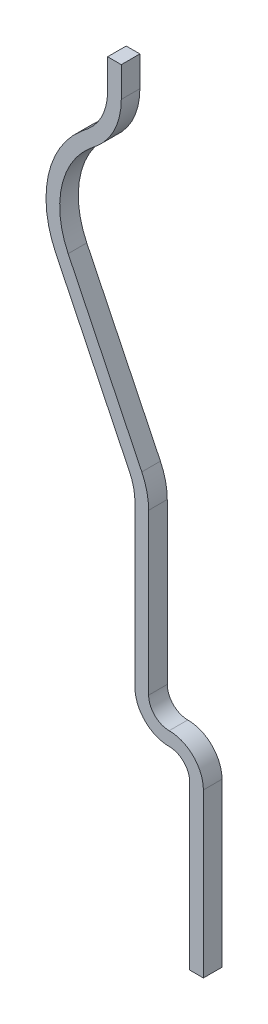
ISO-10303-21;
HEADER;
FILE_DESCRIPTION(('STEP AP214'),'2;1');
FILE_NAME('part.step','',(''),(''),'','','');
FILE_SCHEMA(('AUTOMOTIVE_DESIGN { 1 0 10303 214 1 1 1 1 }'));
ENDSEC;
DATA;
#1=APPLICATION_CONTEXT('core data for automotive mechanical design processes');
#2=APPLICATION_PROTOCOL_DEFINITION('international standard','automotive_design',2000,#1);
#3=PRODUCT_CONTEXT('',#1,'mechanical');
#4=PRODUCT('Part','Part','',(#3));
#5=PRODUCT_RELATED_PRODUCT_CATEGORY('part','',(#4));
#6=PRODUCT_DEFINITION_FORMATION('','',#4);
#7=PRODUCT_DEFINITION_CONTEXT('part definition',#1,'design');
#8=PRODUCT_DEFINITION('design','',#6,#7);
#9=PRODUCT_DEFINITION_SHAPE('','',#8);
#10=(LENGTH_UNIT() NAMED_UNIT(*) SI_UNIT(.MILLI.,.METRE.));
#11=(NAMED_UNIT(*) PLANE_ANGLE_UNIT() SI_UNIT($,.RADIAN.));
#12=(NAMED_UNIT(*) SI_UNIT($,.STERADIAN.) SOLID_ANGLE_UNIT());
#13=UNCERTAINTY_MEASURE_WITH_UNIT(LENGTH_MEASURE(1.E-05),#10,'distance_accuracy_value','');
#14=(GEOMETRIC_REPRESENTATION_CONTEXT(3) GLOBAL_UNCERTAINTY_ASSIGNED_CONTEXT((#13)) GLOBAL_UNIT_ASSIGNED_CONTEXT((#10,
#11,#12)) REPRESENTATION_CONTEXT('',''));
#15=CARTESIAN_POINT('',(0.,0.,0.));
#16=DIRECTION('',(0.,0.,1.));
#17=DIRECTION('',(1.,0.,0.));
#18=AXIS2_PLACEMENT_3D('',#15,#16,#17);
#19=CARTESIAN_POINT('',(0.875,0.,0.34));
#20=DIRECTION('',(1.,0.,0.));
#21=DIRECTION('',(0.,1.,0.));
#22=AXIS2_PLACEMENT_3D('',#19,#20,#21);
#23=PLANE('',#22);
#24=DIRECTION('',(0.,-1.,0.));
#25=VECTOR('',#24,1.);
#26=CARTESIAN_POINT('',(0.875,0.,0.));
#27=LINE('',#26,#25);
#28=CARTESIAN_POINT('',(0.875,2.975,0.));
#29=VERTEX_POINT('',#28);
#30=CARTESIAN_POINT('',(0.875,0.,0.));
#31=VERTEX_POINT('',#30);
#32=EDGE_CURVE('E215',#29,#31,#27,.T.);
#33=ORIENTED_EDGE('',*,*,#32,.T.);
#34=DIRECTION('',(0.,0.,-1.));
#35=VECTOR('',#34,1.);
#36=CARTESIAN_POINT('',(0.875,0.,0.34));
#37=LINE('',#36,#35);
#38=CARTESIAN_POINT('',(0.875,0.,0.34));
#39=VERTEX_POINT('',#38);
#40=EDGE_CURVE('E11',#39,#31,#37,.T.);
#41=ORIENTED_EDGE('',*,*,#40,.F.);
#42=DIRECTION('',(0.,-1.,0.));
#43=VECTOR('',#42,1.);
#44=CARTESIAN_POINT('',(0.875,0.,0.34));
#45=LINE('',#44,#43);
#46=CARTESIAN_POINT('',(0.875,2.975,0.34));
#47=VERTEX_POINT('',#46);
#48=EDGE_CURVE('E257',#47,#39,#45,.T.);
#49=ORIENTED_EDGE('',*,*,#48,.F.);
#50=DIRECTION('',(0.,0.,-1.));
#51=VECTOR('',#50,1.);
#52=CARTESIAN_POINT('',(0.875,2.975,0.34));
#53=LINE('',#52,#51);
#54=EDGE_CURVE('E211',#47,#29,#53,.T.);
#55=ORIENTED_EDGE('',*,*,#54,.T.);
#56=EDGE_LOOP('',(#33,#41,#49,#55));
#57=FACE_BOUND('',#56,.T.);
#58=ADVANCED_FACE('F35',(#57),#23,.F.);
#59=CARTESIAN_POINT('',(0.875,0.,0.34));
#60=DIRECTION('',(0.,1.,0.));
#61=DIRECTION('',(0.,0.,1.));
#62=AXIS2_PLACEMENT_3D('',#59,#60,#61);
#63=PLANE('',#62);
#64=DIRECTION('',(1.,0.,0.));
#65=VECTOR('',#64,1.);
#66=CARTESIAN_POINT('',(0.875,0.,0.));
#67=LINE('',#66,#65);
#68=CARTESIAN_POINT('',(1.125,0.,0.));
#69=VERTEX_POINT('',#68);
#70=EDGE_CURVE('E218',#31,#69,#67,.T.);
#71=ORIENTED_EDGE('',*,*,#70,.T.);
#72=DIRECTION('',(0.,0.,-1.));
#73=VECTOR('',#72,1.);
#74=CARTESIAN_POINT('',(1.125,0.,0.34));
#75=LINE('',#74,#73);
#76=CARTESIAN_POINT('',(1.125,0.,0.34));
#77=VERTEX_POINT('',#76);
#78=EDGE_CURVE('E43',#77,#69,#75,.T.);
#79=ORIENTED_EDGE('',*,*,#78,.F.);
#80=DIRECTION('',(1.,0.,0.));
#81=VECTOR('',#80,1.);
#82=CARTESIAN_POINT('',(0.875,0.,0.34));
#83=LINE('',#82,#81);
#84=EDGE_CURVE('E136',#39,#77,#83,.T.);
#85=ORIENTED_EDGE('',*,*,#84,.F.);
#86=ORIENTED_EDGE('',*,*,#40,.T.);
#87=EDGE_LOOP('',(#71,#79,#85,#86));
#88=FACE_BOUND('',#87,.T.);
#89=ADVANCED_FACE('F385',(#88),#63,.F.);
#90=CARTESIAN_POINT('',(1.125,0.,0.34));
#91=DIRECTION('',(-1.,0.,0.));
#92=DIRECTION('',(0.,0.,1.));
#93=AXIS2_PLACEMENT_3D('',#90,#91,#92);
#94=PLANE('',#93);
#95=DIRECTION('',(0.,1.,0.));
#96=VECTOR('',#95,1.);
#97=CARTESIAN_POINT('',(1.125,0.,0.));
#98=LINE('',#97,#96);
#99=CARTESIAN_POINT('',(1.125,2.975,0.));
#100=VERTEX_POINT('',#99);
#101=EDGE_CURVE('E220',#69,#100,#98,.T.);
#102=ORIENTED_EDGE('',*,*,#101,.T.);
#103=DIRECTION('',(0.,0.,-1.));
#104=VECTOR('',#103,1.);
#105=CARTESIAN_POINT('',(1.125,2.975,0.34));
#106=LINE('',#105,#104);
#107=CARTESIAN_POINT('',(1.125,2.975,0.34));
#108=VERTEX_POINT('',#107);
#109=EDGE_CURVE('E306',#108,#100,#106,.T.);
#110=ORIENTED_EDGE('',*,*,#109,.F.);
#111=DIRECTION('',(0.,1.,0.));
#112=VECTOR('',#111,1.);
#113=CARTESIAN_POINT('',(1.125,0.,0.34));
#114=LINE('',#113,#112);
#115=EDGE_CURVE('E314',#77,#108,#114,.T.);
#116=ORIENTED_EDGE('',*,*,#115,.F.);
#117=ORIENTED_EDGE('',*,*,#78,.T.);
#118=EDGE_LOOP('',(#102,#110,#116,#117));
#119=FACE_BOUND('',#118,.T.);
#120=ADVANCED_FACE('F312',(#119),#94,.F.);
#121=CARTESIAN_POINT('',(0.500000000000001,2.975,0.34));
#122=DIRECTION('',(0.,0.,-1.));
#123=DIRECTION('',(-1.,0.,0.));
#124=AXIS2_PLACEMENT_3D('',#121,#122,#123);
#125=CYLINDRICAL_SURFACE('',#124,0.624999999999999);
#126=CARTESIAN_POINT('',(0.500000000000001,2.975,0.));
#127=DIRECTION('',(0.,0.,1.));
#128=DIRECTION('',(-1.,0.,0.));
#129=AXIS2_PLACEMENT_3D('',#126,#127,#128);
#130=CIRCLE('',#129,0.624999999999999);
#131=CARTESIAN_POINT('',(0.500000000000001,3.6,0.));
#132=VERTEX_POINT('',#131);
#133=EDGE_CURVE('E222',#100,#132,#130,.T.);
#134=ORIENTED_EDGE('',*,*,#133,.T.);
#135=DIRECTION('',(0.,0.,-1.));
#136=VECTOR('',#135,1.);
#137=CARTESIAN_POINT('',(0.500000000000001,3.6,0.34));
#138=LINE('',#137,#136);
#139=CARTESIAN_POINT('',(0.500000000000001,3.6,0.34));
#140=VERTEX_POINT('',#139);
#141=EDGE_CURVE('E303',#140,#132,#138,.T.);
#142=ORIENTED_EDGE('',*,*,#141,.F.);
#143=CARTESIAN_POINT('',(0.500000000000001,2.975,0.34));
#144=DIRECTION('',(0.,0.,1.));
#145=DIRECTION('',(-1.,0.,0.));
#146=AXIS2_PLACEMENT_3D('',#143,#144,#145);
#147=CIRCLE('',#146,0.624999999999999);
#148=EDGE_CURVE('E332',#108,#140,#147,.T.);
#149=ORIENTED_EDGE('',*,*,#148,.F.);
#150=ORIENTED_EDGE('',*,*,#109,.T.);
#151=EDGE_LOOP('',(#134,#142,#149,#150));
#152=FACE_BOUND('',#151,.T.);
#153=ADVANCED_FACE('F323',(#152),#125,.T.);
#154=CARTESIAN_POINT('',(0.500000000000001,3.975,0.34));
#155=DIRECTION('',(0.,0.,-1.));
#156=DIRECTION('',(-1.,0.,0.));
#157=AXIS2_PLACEMENT_3D('',#154,#155,#156);
#158=CYLINDRICAL_SURFACE('',#157,0.375);
#159=CARTESIAN_POINT('',(0.500000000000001,3.975,0.));
#160=DIRECTION('',(0.,0.,-1.));
#161=DIRECTION('',(1.,0.,0.));
#162=AXIS2_PLACEMENT_3D('',#159,#160,#161);
#163=CIRCLE('',#162,0.375);
#164=CARTESIAN_POINT('',(0.125000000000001,3.975,0.));
#165=VERTEX_POINT('',#164);
#166=EDGE_CURVE('E224',#132,#165,#163,.T.);
#167=ORIENTED_EDGE('',*,*,#166,.T.);
#168=DIRECTION('',(0.,0.,-1.));
#169=VECTOR('',#168,1.);
#170=CARTESIAN_POINT('',(0.125000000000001,3.975,0.34));
#171=LINE('',#170,#169);
#172=CARTESIAN_POINT('',(0.125000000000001,3.975,0.34));
#173=VERTEX_POINT('',#172);
#174=EDGE_CURVE('E300',#173,#165,#171,.T.);
#175=ORIENTED_EDGE('',*,*,#174,.F.);
#176=CARTESIAN_POINT('',(0.500000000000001,3.975,0.34));
#177=DIRECTION('',(0.,0.,-1.));
#178=DIRECTION('',(1.,0.,0.));
#179=AXIS2_PLACEMENT_3D('',#176,#177,#178);
#180=CIRCLE('',#179,0.375);
#181=EDGE_CURVE('E329',#140,#173,#180,.T.);
#182=ORIENTED_EDGE('',*,*,#181,.F.);
#183=ORIENTED_EDGE('',*,*,#141,.T.);
#184=EDGE_LOOP('',(#167,#175,#182,#183));
#185=FACE_BOUND('',#184,.T.);
#186=ADVANCED_FACE('F327',(#185),#158,.F.);
#187=CARTESIAN_POINT('',(0.125,6.9,0.34));
#188=DIRECTION('',(-1.,0.,0.));
#189=DIRECTION('',(0.,-1.,0.));
#190=AXIS2_PLACEMENT_3D('',#187,#188,#189);
#191=PLANE('',#190);
#192=DIRECTION('',(0.,1.,0.));
#193=VECTOR('',#192,1.);
#194=CARTESIAN_POINT('',(0.125,6.9,0.));
#195=LINE('',#194,#193);
#196=CARTESIAN_POINT('',(0.125,6.9,0.));
#197=VERTEX_POINT('',#196);
#198=EDGE_CURVE('E226',#165,#197,#195,.T.);
#199=ORIENTED_EDGE('',*,*,#198,.T.);
#200=DIRECTION('',(0.,0.,-1.));
#201=VECTOR('',#200,1.);
#202=CARTESIAN_POINT('',(0.125,6.9,0.34));
#203=LINE('',#202,#201);
#204=CARTESIAN_POINT('',(0.125,6.9,0.34));
#205=VERTEX_POINT('',#204);
#206=EDGE_CURVE('E297',#205,#197,#203,.T.);
#207=ORIENTED_EDGE('',*,*,#206,.F.);
#208=DIRECTION('',(0.,1.,0.));
#209=VECTOR('',#208,1.);
#210=CARTESIAN_POINT('',(0.125,6.9,0.34));
#211=LINE('',#210,#209);
#212=EDGE_CURVE('E331',#173,#205,#211,.T.);
#213=ORIENTED_EDGE('',*,*,#212,.F.);
#214=ORIENTED_EDGE('',*,*,#174,.T.);
#215=EDGE_LOOP('',(#199,#207,#213,#214));
#216=FACE_BOUND('',#215,.T.);
#217=ADVANCED_FACE('F398',(#216),#191,.F.);
#218=CARTESIAN_POINT('',(-1.125,6.9,0.34));
#219=DIRECTION('',(0.,0.,-1.));
#220=DIRECTION('',(-1.,0.,0.));
#221=AXIS2_PLACEMENT_3D('',#218,#219,#220);
#222=CYLINDRICAL_SURFACE('',#221,1.25);
#223=CARTESIAN_POINT('',(-1.125,6.9,0.));
#224=DIRECTION('',(0.,0.,1.));
#225=DIRECTION('',(1.,0.,0.));
#226=AXIS2_PLACEMENT_3D('',#223,#224,#225);
#227=CIRCLE('',#226,1.25);
#228=CARTESIAN_POINT('',(0.000186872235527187,7.44447635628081,0.));
#229=VERTEX_POINT('',#228);
#230=EDGE_CURVE('E228',#197,#229,#227,.T.);
#231=ORIENTED_EDGE('',*,*,#230,.T.);
#232=DIRECTION('',(0.,0.,-1.));
#233=VECTOR('',#232,1.);
#234=CARTESIAN_POINT('',(0.000186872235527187,7.44447635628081,0.34));
#235=LINE('',#234,#233);
#236=CARTESIAN_POINT('',(0.000186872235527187,7.44447635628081,0.34));
#237=VERTEX_POINT('',#236);
#238=EDGE_CURVE('E294',#237,#229,#235,.T.);
#239=ORIENTED_EDGE('',*,*,#238,.F.);
#240=CARTESIAN_POINT('',(-1.125,6.9,0.34));
#241=DIRECTION('',(0.,0.,1.));
#242=DIRECTION('',(1.,0.,0.));
#243=AXIS2_PLACEMENT_3D('',#240,#241,#242);
#244=CIRCLE('',#243,1.25);
#245=EDGE_CURVE('E334',#205,#237,#244,.T.);
#246=ORIENTED_EDGE('',*,*,#245,.F.);
#247=ORIENTED_EDGE('',*,*,#206,.T.);
#248=EDGE_LOOP('',(#231,#239,#246,#247));
#249=FACE_BOUND('',#248,.T.);
#250=ADVANCED_FACE('F401',(#249),#222,.T.);
#251=CARTESIAN_POINT('',(-1.34523172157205,10.2248493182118,0.34));
#252=DIRECTION('',(-0.900149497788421,-0.435581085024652,0.));
#253=DIRECTION('',(0.435581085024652,-0.900149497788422,0.));
#254=AXIS2_PLACEMENT_3D('',#251,#252,#253);
#255=PLANE('',#254);
#256=DIRECTION('',(-0.435581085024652,0.900149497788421,0.));
#257=VECTOR('',#256,1.);
#258=CARTESIAN_POINT('',(-1.34523172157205,10.2248493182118,0.));
#259=LINE('',#258,#257);
#260=CARTESIAN_POINT('',(-1.34523172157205,10.2248493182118,0.));
#261=VERTEX_POINT('',#260);
#262=EDGE_CURVE('E230',#229,#261,#259,.T.);
#263=ORIENTED_EDGE('',*,*,#262,.T.);
#264=DIRECTION('',(0.,0.,-1.));
#265=VECTOR('',#264,1.);
#266=CARTESIAN_POINT('',(-1.34523172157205,10.2248493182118,0.34));
#267=LINE('',#266,#265);
#268=CARTESIAN_POINT('',(-1.34523172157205,10.2248493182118,0.34));
#269=VERTEX_POINT('',#268);
#270=EDGE_CURVE('E291',#269,#261,#267,.T.);
#271=ORIENTED_EDGE('',*,*,#270,.F.);
#272=DIRECTION('',(-0.435581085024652,0.900149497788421,0.));
#273=VECTOR('',#272,1.);
#274=CARTESIAN_POINT('',(-1.34523172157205,10.2248493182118,0.34));
#275=LINE('',#274,#273);
#276=EDGE_CURVE('E340',#237,#269,#275,.T.);
#277=ORIENTED_EDGE('',*,*,#276,.F.);
#278=ORIENTED_EDGE('',*,*,#238,.T.);
#279=EDGE_LOOP('',(#263,#271,#277,#278));
#280=FACE_BOUND('',#279,.T.);
#281=ADVANCED_FACE('F405',(#280),#255,.F.);
#282=CARTESIAN_POINT('',(0.0500000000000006,10.9,0.34));
#283=DIRECTION('',(0.,0.,-1.));
#284=DIRECTION('',(-1.,0.,0.));
#285=AXIS2_PLACEMENT_3D('',#282,#283,#284);
#286=CYLINDRICAL_SURFACE('',#285,1.55);
#287=CARTESIAN_POINT('',(0.0500000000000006,10.9,0.));
#288=DIRECTION('',(0.,0.,-1.));
#289=DIRECTION('',(1.,0.,0.));
#290=AXIS2_PLACEMENT_3D('',#287,#288,#289);
#291=CIRCLE('',#290,1.55);
#292=CARTESIAN_POINT('',(-0.948252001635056,12.0857457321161,0.));
#293=VERTEX_POINT('',#292);
#294=EDGE_CURVE('E232',#261,#293,#291,.T.);
#295=ORIENTED_EDGE('',*,*,#294,.T.);
#296=DIRECTION('',(0.,0.,-1.));
#297=VECTOR('',#296,1.);
#298=CARTESIAN_POINT('',(-0.948252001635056,12.0857457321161,0.34));
#299=LINE('',#298,#297);
#300=CARTESIAN_POINT('',(-0.948252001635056,12.0857457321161,0.34));
#301=VERTEX_POINT('',#300);
#302=EDGE_CURVE('E288',#301,#293,#299,.T.);
#303=ORIENTED_EDGE('',*,*,#302,.F.);
#304=CARTESIAN_POINT('',(0.0500000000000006,10.9,0.34));
#305=DIRECTION('',(0.,0.,-1.));
#306=DIRECTION('',(1.,0.,0.));
#307=AXIS2_PLACEMENT_3D('',#304,#305,#306);
#308=CIRCLE('',#307,1.55);
#309=EDGE_CURVE('E342',#269,#301,#308,.T.);
#310=ORIENTED_EDGE('',*,*,#309,.F.);
#311=ORIENTED_EDGE('',*,*,#270,.T.);
#312=EDGE_LOOP('',(#295,#303,#310,#311));
#313=FACE_BOUND('',#312,.T.);
#314=ADVANCED_FACE('F409',(#313),#286,.F.);
#315=CARTESIAN_POINT('',(-0.819958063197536,12.1937534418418,0.34));
#316=DIRECTION('',(-0.644033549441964,0.764997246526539,0.));
#317=DIRECTION('',(-0.764997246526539,-0.644033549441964,0.));
#318=AXIS2_PLACEMENT_3D('',#315,#316,#317);
#319=PLANE('',#318);
#320=DIRECTION('',(0.764997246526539,0.644033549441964,0.));
#321=VECTOR('',#320,1.);
#322=CARTESIAN_POINT('',(-0.819958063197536,12.1937534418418,0.));
#323=LINE('',#322,#321);
#324=CARTESIAN_POINT('',(-0.819958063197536,12.1937534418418,0.));
#325=VERTEX_POINT('',#324);
#326=EDGE_CURVE('E234',#293,#325,#323,.T.);
#327=ORIENTED_EDGE('',*,*,#326,.T.);
#328=DIRECTION('',(0.,0.,-1.));
#329=VECTOR('',#328,1.);
#330=CARTESIAN_POINT('',(-0.819958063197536,12.1937534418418,0.34));
#331=LINE('',#330,#329);
#332=CARTESIAN_POINT('',(-0.819958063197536,12.1937534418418,0.34));
#333=VERTEX_POINT('',#332);
#334=EDGE_CURVE('E285',#333,#325,#331,.T.);
#335=ORIENTED_EDGE('',*,*,#334,.F.);
#336=DIRECTION('',(0.764997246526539,0.644033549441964,0.));
#337=VECTOR('',#336,1.);
#338=CARTESIAN_POINT('',(-0.819958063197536,12.1937534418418,0.34));
#339=LINE('',#338,#337);
#340=EDGE_CURVE('E344',#301,#333,#339,.T.);
#341=ORIENTED_EDGE('',*,*,#340,.F.);
#342=ORIENTED_EDGE('',*,*,#302,.T.);
#343=EDGE_LOOP('',(#327,#335,#341,#342));
#344=FACE_BOUND('',#343,.T.);
#345=ADVANCED_FACE('F413',(#344),#319,.F.);
#346=CARTESIAN_POINT('',(-1.625,13.15,0.34));
#347=DIRECTION('',(0.,0.,-1.));
#348=DIRECTION('',(-1.,0.,0.));
#349=AXIS2_PLACEMENT_3D('',#346,#347,#348);
#350=CYLINDRICAL_SURFACE('',#349,1.25);
#351=CARTESIAN_POINT('',(-1.625,13.15,0.));
#352=DIRECTION('',(0.,0.,1.));
#353=DIRECTION('',(-1.,0.,0.));
#354=AXIS2_PLACEMENT_3D('',#351,#352,#353);
#355=CIRCLE('',#354,1.25);
#356=CARTESIAN_POINT('',(-0.375000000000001,13.15,0.));
#357=VERTEX_POINT('',#356);
#358=EDGE_CURVE('E236',#325,#357,#355,.T.);
#359=ORIENTED_EDGE('',*,*,#358,.T.);
#360=DIRECTION('',(0.,0.,-1.));
#361=VECTOR('',#360,1.);
#362=CARTESIAN_POINT('',(-0.375000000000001,13.15,0.34));
#363=LINE('',#362,#361);
#364=CARTESIAN_POINT('',(-0.375000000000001,13.15,0.34));
#365=VERTEX_POINT('',#364);
#366=EDGE_CURVE('E282',#365,#357,#363,.T.);
#367=ORIENTED_EDGE('',*,*,#366,.F.);
#368=CARTESIAN_POINT('',(-1.625,13.15,0.34));
#369=DIRECTION('',(0.,0.,1.));
#370=DIRECTION('',(-1.,0.,0.));
#371=AXIS2_PLACEMENT_3D('',#368,#369,#370);
#372=CIRCLE('',#371,1.25);
#373=EDGE_CURVE('E346',#333,#365,#372,.T.);
#374=ORIENTED_EDGE('',*,*,#373,.F.);
#375=ORIENTED_EDGE('',*,*,#334,.T.);
#376=EDGE_LOOP('',(#359,#367,#374,#375));
#377=FACE_BOUND('',#376,.T.);
#378=ADVANCED_FACE('F417',(#377),#350,.T.);
#379=CARTESIAN_POINT('',(-0.375,13.7,0.34));
#380=DIRECTION('',(-1.,0.,0.));
#381=DIRECTION('',(0.,0.,1.));
#382=AXIS2_PLACEMENT_3D('',#379,#380,#381);
#383=PLANE('',#382);
#384=DIRECTION('',(0.,1.,0.));
#385=VECTOR('',#384,1.);
#386=CARTESIAN_POINT('',(-0.375,13.7,0.));
#387=LINE('',#386,#385);
#388=CARTESIAN_POINT('',(-0.375,13.7,0.));
#389=VERTEX_POINT('',#388);
#390=EDGE_CURVE('E238',#357,#389,#387,.T.);
#391=ORIENTED_EDGE('',*,*,#390,.T.);
#392=DIRECTION('',(0.,0.,-1.));
#393=VECTOR('',#392,1.);
#394=CARTESIAN_POINT('',(-0.375,13.7,0.34));
#395=LINE('',#394,#393);
#396=CARTESIAN_POINT('',(-0.375,13.7,0.34));
#397=VERTEX_POINT('',#396);
#398=EDGE_CURVE('E279',#397,#389,#395,.T.);
#399=ORIENTED_EDGE('',*,*,#398,.F.);
#400=DIRECTION('',(0.,1.,0.));
#401=VECTOR('',#400,1.);
#402=CARTESIAN_POINT('',(-0.375,13.7,0.34));
#403=LINE('',#402,#401);
#404=EDGE_CURVE('E348',#365,#397,#403,.T.);
#405=ORIENTED_EDGE('',*,*,#404,.F.);
#406=ORIENTED_EDGE('',*,*,#366,.T.);
#407=EDGE_LOOP('',(#391,#399,#405,#406));
#408=FACE_BOUND('',#407,.T.);
#409=ADVANCED_FACE('F421',(#408),#383,.F.);
#410=CARTESIAN_POINT('',(-0.625,13.7,0.34));
#411=DIRECTION('',(0.,-1.,0.));
#412=DIRECTION('',(0.,0.,-1.));
#413=AXIS2_PLACEMENT_3D('',#410,#411,#412);
#414=PLANE('',#413);
#415=DIRECTION('',(-1.,0.,0.));
#416=VECTOR('',#415,1.);
#417=CARTESIAN_POINT('',(-0.625,13.7,0.));
#418=LINE('',#417,#416);
#419=CARTESIAN_POINT('',(-0.625,13.7,0.));
#420=VERTEX_POINT('',#419);
#421=EDGE_CURVE('E240',#389,#420,#418,.T.);
#422=ORIENTED_EDGE('',*,*,#421,.T.);
#423=DIRECTION('',(0.,0.,-1.));
#424=VECTOR('',#423,1.);
#425=CARTESIAN_POINT('',(-0.625,13.7,0.34));
#426=LINE('',#425,#424);
#427=CARTESIAN_POINT('',(-0.625,13.7,0.34));
#428=VERTEX_POINT('',#427);
#429=EDGE_CURVE('E276',#428,#420,#426,.T.);
#430=ORIENTED_EDGE('',*,*,#429,.F.);
#431=DIRECTION('',(-1.,0.,0.));
#432=VECTOR('',#431,1.);
#433=CARTESIAN_POINT('',(-0.625,13.7,0.34));
#434=LINE('',#433,#432);
#435=EDGE_CURVE('E350',#397,#428,#434,.T.);
#436=ORIENTED_EDGE('',*,*,#435,.F.);
#437=ORIENTED_EDGE('',*,*,#398,.T.);
#438=EDGE_LOOP('',(#422,#430,#436,#437));
#439=FACE_BOUND('',#438,.T.);
#440=ADVANCED_FACE('F425',(#439),#414,.F.);
#441=CARTESIAN_POINT('',(-0.625,13.7,0.34));
#442=DIRECTION('',(1.,0.,0.));
#443=DIRECTION('',(0.,0.,-1.));
#444=AXIS2_PLACEMENT_3D('',#441,#442,#443);
#445=PLANE('',#444);
#446=DIRECTION('',(0.,-1.,0.));
#447=VECTOR('',#446,1.);
#448=CARTESIAN_POINT('',(-0.625,13.7,0.));
#449=LINE('',#448,#447);
#450=CARTESIAN_POINT('',(-0.625,13.15,0.));
#451=VERTEX_POINT('',#450);
#452=EDGE_CURVE('E242',#420,#451,#449,.T.);
#453=ORIENTED_EDGE('',*,*,#452,.T.);
#454=DIRECTION('',(0.,0.,-1.));
#455=VECTOR('',#454,1.);
#456=CARTESIAN_POINT('',(-0.625,13.15,0.34));
#457=LINE('',#456,#455);
#458=CARTESIAN_POINT('',(-0.625,13.15,0.34));
#459=VERTEX_POINT('',#458);
#460=EDGE_CURVE('E273',#459,#451,#457,.T.);
#461=ORIENTED_EDGE('',*,*,#460,.F.);
#462=DIRECTION('',(0.,-1.,0.));
#463=VECTOR('',#462,1.);
#464=CARTESIAN_POINT('',(-0.625,13.7,0.34));
#465=LINE('',#464,#463);
#466=EDGE_CURVE('E352',#428,#459,#465,.T.);
#467=ORIENTED_EDGE('',*,*,#466,.F.);
#468=ORIENTED_EDGE('',*,*,#429,.T.);
#469=EDGE_LOOP('',(#453,#461,#467,#468));
#470=FACE_BOUND('',#469,.T.);
#471=ADVANCED_FACE('F429',(#470),#445,.F.);
#472=CARTESIAN_POINT('',(-1.625,13.15,0.34));
#473=DIRECTION('',(0.,0.,-1.));
#474=DIRECTION('',(-1.,0.,0.));
#475=AXIS2_PLACEMENT_3D('',#472,#473,#474);
#476=CYLINDRICAL_SURFACE('',#475,1.);
#477=CARTESIAN_POINT('',(-1.625,13.15,0.));
#478=DIRECTION('',(0.,0.,-1.));
#479=DIRECTION('',(-1.,0.,0.));
#480=AXIS2_PLACEMENT_3D('',#477,#478,#479);
#481=CIRCLE('',#480,1.);
#482=CARTESIAN_POINT('',(-0.980966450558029,12.3850027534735,0.));
#483=VERTEX_POINT('',#482);
#484=EDGE_CURVE('E244',#451,#483,#481,.T.);
#485=ORIENTED_EDGE('',*,*,#484,.T.);
#486=DIRECTION('',(0.,0.,-1.));
#487=VECTOR('',#486,1.);
#488=CARTESIAN_POINT('',(-0.980966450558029,12.3850027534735,0.34));
#489=LINE('',#488,#487);
#490=CARTESIAN_POINT('',(-0.980966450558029,12.3850027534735,0.34));
#491=VERTEX_POINT('',#490);
#492=EDGE_CURVE('E270',#491,#483,#489,.T.);
#493=ORIENTED_EDGE('',*,*,#492,.F.);
#494=CARTESIAN_POINT('',(-1.625,13.15,0.34));
#495=DIRECTION('',(0.,0.,-1.));
#496=DIRECTION('',(-1.,0.,0.));
#497=AXIS2_PLACEMENT_3D('',#494,#495,#496);
#498=CIRCLE('',#497,1.);
#499=EDGE_CURVE('E354',#459,#491,#498,.T.);
#500=ORIENTED_EDGE('',*,*,#499,.F.);
#501=ORIENTED_EDGE('',*,*,#460,.T.);
#502=EDGE_LOOP('',(#485,#493,#500,#501));
#503=FACE_BOUND('',#502,.T.);
#504=ADVANCED_FACE('F433',(#503),#476,.F.);
#505=CARTESIAN_POINT('',(-0.980966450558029,12.3850027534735,0.34));
#506=DIRECTION('',(0.644033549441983,-0.764997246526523,0.));
#507=DIRECTION('',(0.764997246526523,0.644033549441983,0.));
#508=AXIS2_PLACEMENT_3D('',#505,#506,#507);
#509=PLANE('',#508);
#510=DIRECTION('',(-0.764997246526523,-0.644033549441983,0.));
#511=VECTOR('',#510,1.);
#512=CARTESIAN_POINT('',(-0.980966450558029,12.3850027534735,0.));
#513=LINE('',#512,#511);
#514=CARTESIAN_POINT('',(-1.10926038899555,12.2769950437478,0.));
#515=VERTEX_POINT('',#514);
#516=EDGE_CURVE('E246',#483,#515,#513,.T.);
#517=ORIENTED_EDGE('',*,*,#516,.T.);
#518=DIRECTION('',(0.,0.,-1.));
#519=VECTOR('',#518,1.);
#520=CARTESIAN_POINT('',(-1.10926038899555,12.2769950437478,0.34));
#521=LINE('',#520,#519);
#522=CARTESIAN_POINT('',(-1.10926038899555,12.2769950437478,0.34));
#523=VERTEX_POINT('',#522);
#524=EDGE_CURVE('E267',#523,#515,#521,.T.);
#525=ORIENTED_EDGE('',*,*,#524,.F.);
#526=DIRECTION('',(-0.764997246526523,-0.644033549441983,0.));
#527=VECTOR('',#526,1.);
#528=CARTESIAN_POINT('',(-0.980966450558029,12.3850027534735,0.34));
#529=LINE('',#528,#527);
#530=EDGE_CURVE('E356',#491,#523,#529,.T.);
#531=ORIENTED_EDGE('',*,*,#530,.F.);
#532=ORIENTED_EDGE('',*,*,#492,.T.);
#533=EDGE_LOOP('',(#517,#525,#531,#532));
#534=FACE_BOUND('',#533,.T.);
#535=ADVANCED_FACE('F437',(#534),#509,.F.);
#536=CARTESIAN_POINT('',(0.0500000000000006,10.9,0.34));
#537=DIRECTION('',(0.,0.,-1.));
#538=DIRECTION('',(-1.,0.,0.));
#539=AXIS2_PLACEMENT_3D('',#536,#537,#538);
#540=CYLINDRICAL_SURFACE('',#539,1.8);
#541=CARTESIAN_POINT('',(0.0500000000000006,10.9,0.));
#542=DIRECTION('',(0.,0.,1.));
#543=DIRECTION('',(1.,0.,0.));
#544=AXIS2_PLACEMENT_3D('',#541,#542,#543);
#545=CIRCLE('',#544,1.8);
#546=CARTESIAN_POINT('',(-1.57026909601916,10.1159540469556,0.));
#547=VERTEX_POINT('',#546);
#548=EDGE_CURVE('E248',#515,#547,#545,.T.);
#549=ORIENTED_EDGE('',*,*,#548,.T.);
#550=DIRECTION('',(0.,0.,-1.));
#551=VECTOR('',#550,1.);
#552=CARTESIAN_POINT('',(-1.57026909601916,10.1159540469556,0.34));
#553=LINE('',#552,#551);
#554=CARTESIAN_POINT('',(-1.57026909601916,10.1159540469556,0.34));
#555=VERTEX_POINT('',#554);
#556=EDGE_CURVE('E264',#555,#547,#553,.T.);
#557=ORIENTED_EDGE('',*,*,#556,.F.);
#558=CARTESIAN_POINT('',(0.0500000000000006,10.9,0.34));
#559=DIRECTION('',(0.,0.,1.));
#560=DIRECTION('',(1.,0.,0.));
#561=AXIS2_PLACEMENT_3D('',#558,#559,#560);
#562=CIRCLE('',#561,1.8);
#563=EDGE_CURVE('E358',#523,#555,#562,.T.);
#564=ORIENTED_EDGE('',*,*,#563,.F.);
#565=ORIENTED_EDGE('',*,*,#524,.T.);
#566=EDGE_LOOP('',(#549,#557,#564,#565));
#567=FACE_BOUND('',#566,.T.);
#568=ADVANCED_FACE('F441',(#567),#540,.T.);
#569=CARTESIAN_POINT('',(-0.224850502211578,7.33558108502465,0.34));
#570=DIRECTION('',(0.900149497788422,0.435581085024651,0.));
#571=DIRECTION('',(-0.435581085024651,0.900149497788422,0.));
#572=AXIS2_PLACEMENT_3D('',#569,#570,#571);
#573=PLANE('',#572);
#574=DIRECTION('',(0.435581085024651,-0.900149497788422,0.));
#575=VECTOR('',#574,1.);
#576=CARTESIAN_POINT('',(-0.224850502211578,7.33558108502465,0.));
#577=LINE('',#576,#575);
#578=CARTESIAN_POINT('',(-0.224850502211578,7.33558108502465,0.));
#579=VERTEX_POINT('',#578);
#580=EDGE_CURVE('E250',#547,#579,#577,.T.);
#581=ORIENTED_EDGE('',*,*,#580,.T.);
#582=DIRECTION('',(0.,0.,-1.));
#583=VECTOR('',#582,1.);
#584=CARTESIAN_POINT('',(-0.224850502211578,7.33558108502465,0.34));
#585=LINE('',#584,#583);
#586=CARTESIAN_POINT('',(-0.224850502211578,7.33558108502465,0.34));
#587=VERTEX_POINT('',#586);
#588=EDGE_CURVE('E261',#587,#579,#585,.T.);
#589=ORIENTED_EDGE('',*,*,#588,.F.);
#590=DIRECTION('',(0.435581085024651,-0.900149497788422,0.));
#591=VECTOR('',#590,1.);
#592=CARTESIAN_POINT('',(-0.224850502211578,7.33558108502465,0.34));
#593=LINE('',#592,#591);
#594=EDGE_CURVE('E360',#555,#587,#593,.T.);
#595=ORIENTED_EDGE('',*,*,#594,.F.);
#596=ORIENTED_EDGE('',*,*,#556,.T.);
#597=EDGE_LOOP('',(#581,#589,#595,#596));
#598=FACE_BOUND('',#597,.T.);
#599=ADVANCED_FACE('F366',(#598),#573,.F.);
#600=CARTESIAN_POINT('',(-1.125,6.9,0.34));
#601=DIRECTION('',(0.,0.,-1.));
#602=DIRECTION('',(-1.,0.,0.));
#603=AXIS2_PLACEMENT_3D('',#600,#601,#602);
#604=CYLINDRICAL_SURFACE('',#603,1.);
#605=CARTESIAN_POINT('',(-1.125,6.9,0.));
#606=DIRECTION('',(0.,0.,-1.));
#607=DIRECTION('',(1.,0.,0.));
#608=AXIS2_PLACEMENT_3D('',#605,#606,#607);
#609=CIRCLE('',#608,1.);
#610=CARTESIAN_POINT('',(-0.125,6.9,0.));
#611=VERTEX_POINT('',#610);
#612=EDGE_CURVE('E252',#579,#611,#609,.T.);
#613=ORIENTED_EDGE('',*,*,#612,.T.);
#614=DIRECTION('',(0.,0.,-1.));
#615=VECTOR('',#614,1.);
#616=CARTESIAN_POINT('',(-0.125,6.9,0.34));
#617=LINE('',#616,#615);
#618=CARTESIAN_POINT('',(-0.125,6.9,0.34));
#619=VERTEX_POINT('',#618);
#620=EDGE_CURVE('E206',#619,#611,#617,.T.);
#621=ORIENTED_EDGE('',*,*,#620,.F.);
#622=CARTESIAN_POINT('',(-1.125,6.9,0.34));
#623=DIRECTION('',(0.,0.,-1.));
#624=DIRECTION('',(1.,0.,0.));
#625=AXIS2_PLACEMENT_3D('',#622,#623,#624);
#626=CIRCLE('',#625,1.);
#627=EDGE_CURVE('E197',#587,#619,#626,.T.);
#628=ORIENTED_EDGE('',*,*,#627,.F.);
#629=ORIENTED_EDGE('',*,*,#588,.T.);
#630=EDGE_LOOP('',(#613,#621,#628,#629));
#631=FACE_BOUND('',#630,.T.);
#632=ADVANCED_FACE('F370',(#631),#604,.F.);
#633=CARTESIAN_POINT('',(-0.125,6.9,0.34));
#634=DIRECTION('',(1.,0.,0.));
#635=DIRECTION('',(0.,1.,0.));
#636=AXIS2_PLACEMENT_3D('',#633,#634,#635);
#637=PLANE('',#636);
#638=DIRECTION('',(0.,-1.,0.));
#639=VECTOR('',#638,1.);
#640=CARTESIAN_POINT('',(-0.125,6.9,0.));
#641=LINE('',#640,#639);
#642=CARTESIAN_POINT('',(-0.125,3.975,0.));
#643=VERTEX_POINT('',#642);
#644=EDGE_CURVE('E205',#611,#643,#641,.T.);
#645=ORIENTED_EDGE('',*,*,#644,.T.);
#646=DIRECTION('',(0.,0.,-1.));
#647=VECTOR('',#646,1.);
#648=CARTESIAN_POINT('',(-0.125,3.975,0.34));
#649=LINE('',#648,#647);
#650=CARTESIAN_POINT('',(-0.125,3.975,0.34));
#651=VERTEX_POINT('',#650);
#652=EDGE_CURVE('E202',#651,#643,#649,.T.);
#653=ORIENTED_EDGE('',*,*,#652,.F.);
#654=DIRECTION('',(0.,-1.,0.));
#655=VECTOR('',#654,1.);
#656=CARTESIAN_POINT('',(-0.125,6.9,0.34));
#657=LINE('',#656,#655);
#658=EDGE_CURVE('E191',#619,#651,#657,.T.);
#659=ORIENTED_EDGE('',*,*,#658,.F.);
#660=ORIENTED_EDGE('',*,*,#620,.T.);
#661=EDGE_LOOP('',(#645,#653,#659,#660));
#662=FACE_BOUND('',#661,.T.);
#663=ADVANCED_FACE('F203',(#662),#637,.F.);
#664=CARTESIAN_POINT('',(0.500000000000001,3.975,0.34));
#665=DIRECTION('',(0.,0.,-1.));
#666=DIRECTION('',(-1.,0.,0.));
#667=AXIS2_PLACEMENT_3D('',#664,#665,#666);
#668=CYLINDRICAL_SURFACE('',#667,0.625);
#669=CARTESIAN_POINT('',(0.500000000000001,3.975,0.));
#670=DIRECTION('',(0.,0.,1.));
#671=DIRECTION('',(-1.,0.,0.));
#672=AXIS2_PLACEMENT_3D('',#669,#670,#671);
#673=CIRCLE('',#672,0.625);
#674=CARTESIAN_POINT('',(0.500000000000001,3.35,0.));
#675=VERTEX_POINT('',#674);
#676=EDGE_CURVE('E122',#643,#675,#673,.T.);
#677=ORIENTED_EDGE('',*,*,#676,.T.);
#678=DIRECTION('',(0.,0.,-1.));
#679=VECTOR('',#678,1.);
#680=CARTESIAN_POINT('',(0.500000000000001,3.35,0.34));
#681=LINE('',#680,#679);
#682=CARTESIAN_POINT('',(0.500000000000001,3.35,0.34));
#683=VERTEX_POINT('',#682);
#684=EDGE_CURVE('E207',#683,#675,#681,.T.);
#685=ORIENTED_EDGE('',*,*,#684,.F.);
#686=CARTESIAN_POINT('',(0.500000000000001,3.975,0.34));
#687=DIRECTION('',(0.,0.,1.));
#688=DIRECTION('',(-1.,0.,0.));
#689=AXIS2_PLACEMENT_3D('',#686,#687,#688);
#690=CIRCLE('',#689,0.625);
#691=EDGE_CURVE('E195',#651,#683,#690,.T.);
#692=ORIENTED_EDGE('',*,*,#691,.F.);
#693=ORIENTED_EDGE('',*,*,#652,.T.);
#694=EDGE_LOOP('',(#677,#685,#692,#693));
#695=FACE_BOUND('',#694,.T.);
#696=ADVANCED_FACE('F209',(#695),#668,.T.);
#697=CARTESIAN_POINT('',(0.500000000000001,2.975,0.34));
#698=DIRECTION('',(0.,0.,-1.));
#699=DIRECTION('',(-1.,0.,0.));
#700=AXIS2_PLACEMENT_3D('',#697,#698,#699);
#701=CYLINDRICAL_SURFACE('',#700,0.374999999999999);
#702=CARTESIAN_POINT('',(0.500000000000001,2.975,0.));
#703=DIRECTION('',(0.,0.,-1.));
#704=DIRECTION('',(1.,0.,0.));
#705=AXIS2_PLACEMENT_3D('',#702,#703,#704);
#706=CIRCLE('',#705,0.374999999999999);
#707=EDGE_CURVE('E128',#675,#29,#706,.T.);
#708=ORIENTED_EDGE('',*,*,#707,.T.);
#709=ORIENTED_EDGE('',*,*,#54,.F.);
#710=CARTESIAN_POINT('',(0.500000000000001,2.975,0.34));
#711=DIRECTION('',(0.,0.,-1.));
#712=DIRECTION('',(1.,0.,0.));
#713=AXIS2_PLACEMENT_3D('',#710,#711,#712);
#714=CIRCLE('',#713,0.374999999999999);
#715=EDGE_CURVE('E51',#683,#47,#714,.T.);
#716=ORIENTED_EDGE('',*,*,#715,.F.);
#717=ORIENTED_EDGE('',*,*,#684,.T.);
#718=EDGE_LOOP('',(#708,#709,#716,#717));
#719=FACE_BOUND('',#718,.T.);
#720=ADVANCED_FACE('F374',(#719),#701,.F.);
#721=CARTESIAN_POINT('',(0.500000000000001,2.975,0.34));
#722=DIRECTION('',(0.,0.,1.));
#723=DIRECTION('',(1.,0.,0.));
#724=AXIS2_PLACEMENT_3D('',#721,#722,#723);
#725=PLANE('',#724);
#726=ORIENTED_EDGE('',*,*,#48,.T.);
#727=ORIENTED_EDGE('',*,*,#84,.T.);
#728=ORIENTED_EDGE('',*,*,#115,.T.);
#729=ORIENTED_EDGE('',*,*,#148,.T.);
#730=ORIENTED_EDGE('',*,*,#181,.T.);
#731=ORIENTED_EDGE('',*,*,#212,.T.);
#732=ORIENTED_EDGE('',*,*,#245,.T.);
#733=ORIENTED_EDGE('',*,*,#276,.T.);
#734=ORIENTED_EDGE('',*,*,#309,.T.);
#735=ORIENTED_EDGE('',*,*,#340,.T.);
#736=ORIENTED_EDGE('',*,*,#373,.T.);
#737=ORIENTED_EDGE('',*,*,#404,.T.);
#738=ORIENTED_EDGE('',*,*,#435,.T.);
#739=ORIENTED_EDGE('',*,*,#466,.T.);
#740=ORIENTED_EDGE('',*,*,#499,.T.);
#741=ORIENTED_EDGE('',*,*,#530,.T.);
#742=ORIENTED_EDGE('',*,*,#563,.T.);
#743=ORIENTED_EDGE('',*,*,#594,.T.);
#744=ORIENTED_EDGE('',*,*,#627,.T.);
#745=ORIENTED_EDGE('',*,*,#658,.T.);
#746=ORIENTED_EDGE('',*,*,#691,.T.);
#747=ORIENTED_EDGE('',*,*,#715,.T.);
#748=EDGE_LOOP('',(#726,#727,#728,#729,#730,#731,#732,#733,#734,#735,#736,#737,#738,#739,#740,
#741,#742,#743,#744,#745,#746,#747));
#749=FACE_BOUND('',#748,.T.);
#750=ADVANCED_FACE('F193',(#749),#725,.T.);
#751=CARTESIAN_POINT('',(0.500000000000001,2.975,0.));
#752=DIRECTION('',(0.,0.,1.));
#753=DIRECTION('',(1.,0.,0.));
#754=AXIS2_PLACEMENT_3D('',#751,#752,#753);
#755=PLANE('',#754);
#756=ORIENTED_EDGE('',*,*,#32,.F.);
#757=ORIENTED_EDGE('',*,*,#707,.F.);
#758=ORIENTED_EDGE('',*,*,#676,.F.);
#759=ORIENTED_EDGE('',*,*,#644,.F.);
#760=ORIENTED_EDGE('',*,*,#612,.F.);
#761=ORIENTED_EDGE('',*,*,#580,.F.);
#762=ORIENTED_EDGE('',*,*,#548,.F.);
#763=ORIENTED_EDGE('',*,*,#516,.F.);
#764=ORIENTED_EDGE('',*,*,#484,.F.);
#765=ORIENTED_EDGE('',*,*,#452,.F.);
#766=ORIENTED_EDGE('',*,*,#421,.F.);
#767=ORIENTED_EDGE('',*,*,#390,.F.);
#768=ORIENTED_EDGE('',*,*,#358,.F.);
#769=ORIENTED_EDGE('',*,*,#326,.F.);
#770=ORIENTED_EDGE('',*,*,#294,.F.);
#771=ORIENTED_EDGE('',*,*,#262,.F.);
#772=ORIENTED_EDGE('',*,*,#230,.F.);
#773=ORIENTED_EDGE('',*,*,#198,.F.);
#774=ORIENTED_EDGE('',*,*,#166,.F.);
#775=ORIENTED_EDGE('',*,*,#133,.F.);
#776=ORIENTED_EDGE('',*,*,#101,.F.);
#777=ORIENTED_EDGE('',*,*,#70,.F.);
#778=EDGE_LOOP('',(#756,#757,#758,#759,#760,#761,#762,#763,#764,#765,#766,#767,#768,#769,#770,
#771,#772,#773,#774,#775,#776,#777));
#779=FACE_BOUND('',#778,.T.);
#780=ADVANCED_FACE('F318',(#779),#755,.F.);
#781=CLOSED_SHELL('',(#58,#89,#120,#153,#186,#217,#250,#281,#314,#345,#378,#409,#440,#471,#504,
#535,#568,#599,#632,#663,#696,#720,#750,#780));
#782=MANIFOLD_SOLID_BREP('B2',#781);
#783=ADVANCED_BREP_SHAPE_REPRESENTATION('',(#18,#782),#14);
#784=SHAPE_DEFINITION_REPRESENTATION(#9,#783);
ENDSEC;
END-ISO-10303-21;
